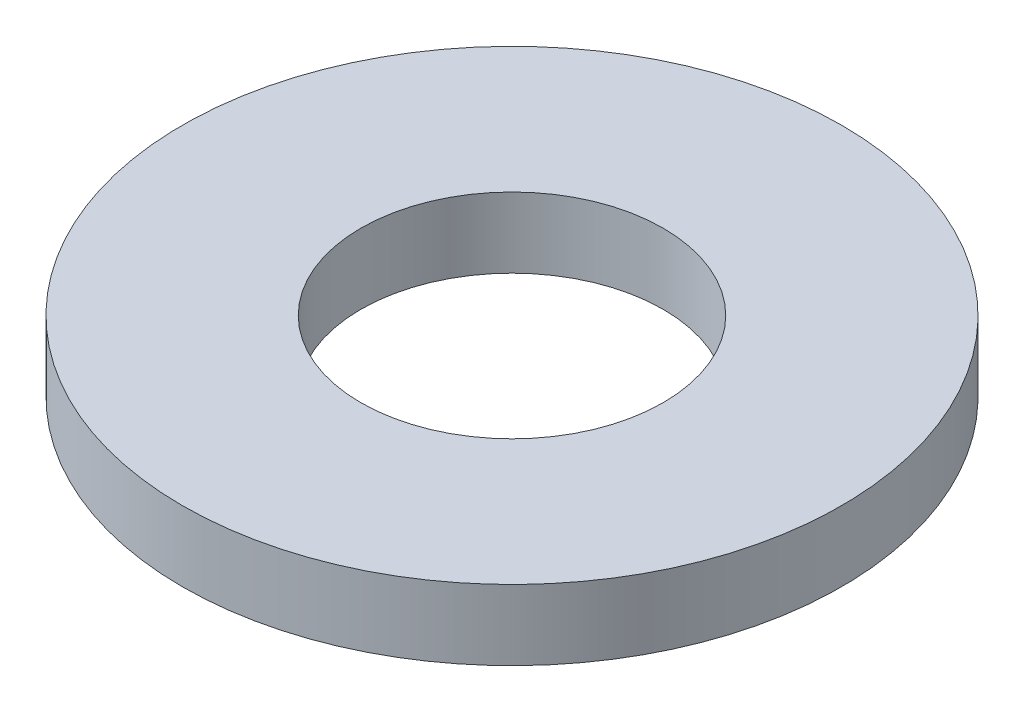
from build123d import *

# Parameters (mm, degrees)
SKETCH1_R           = 4.7625
BOSS_EXTRUDE1_DEPTH = 1.016
SKETCH5_R           = 2.1844
CUT_EXTRUDE1_DEPTH  = 7.811392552


with BuildPart() as part:
    # Sketch1 → Boss-Extrude1 (new body)
    with BuildSketch(Plane(origin=(0, 0, 0), x_dir=(1, 0, 0), z_dir=(0, 1, 0))):
        with Locations(Location((0, 0, 0), (0, 0, 270))):
            Circle(SKETCH1_R)
    extrude(amount=BOSS_EXTRUDE1_DEPTH)

    # Sketch5 → Cut-Extrude1 (cut, through all)
    with BuildSketch(Plane(origin=(0, 1.016, 0), x_dir=(-1, 0, 0), z_dir=(0, 1, 0))):
        with Locations(Location((0, 0, 0), (0, 0, 90))):
            Circle(SKETCH5_R)
    extrude(amount=-CUT_EXTRUDE1_DEPTH, mode=Mode.SUBTRACT)


solid = part.part
